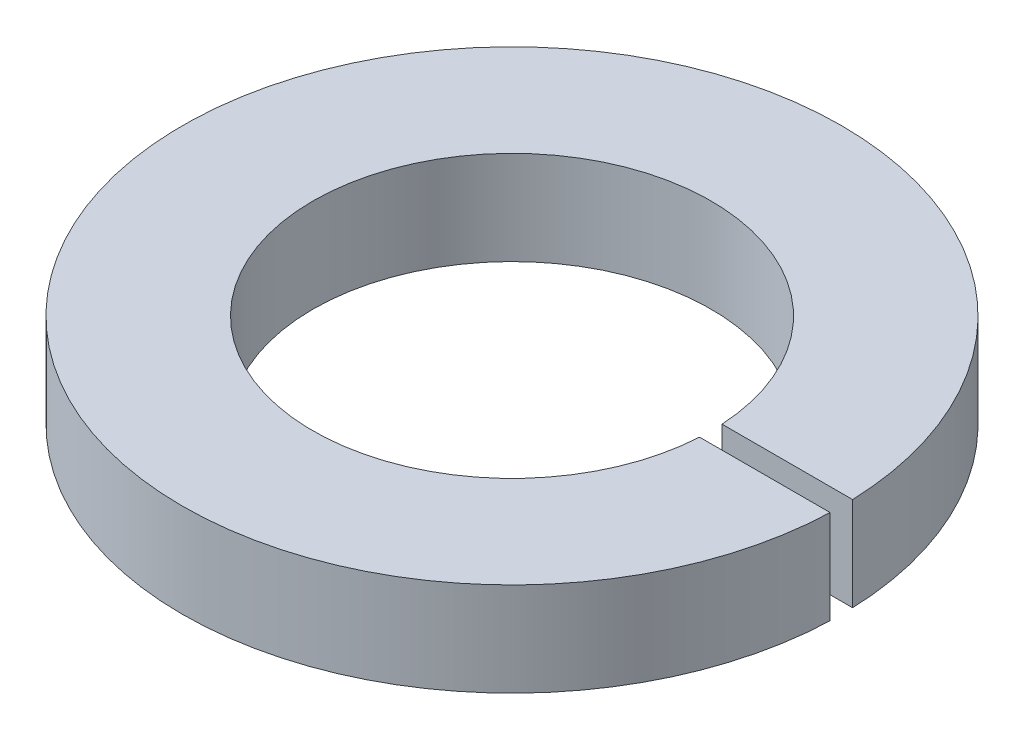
from build123d import *

# Parameters (mm, degrees)
SKETCH1_R          = 11.1633
SKETCH1_R_2        = 6.7437
BASE_EXTRUDE_DEPTH = 3.175
CUT_EXTRUDE1_DEPTH = 17.103389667


with BuildPart() as part:
    # Sketch1 → Base-Extrude (new body)
    with BuildSketch(Plane(origin=(0, 0, 0), x_dir=(1, 0, 0), z_dir=(0, 1, 0))):
        with Locations(Location((0, 0, 0), (0, 0, 270))):
            Circle(SKETCH1_R)
        with Locations(Location((0, 0, 0), (0, 0, 270))):
            Circle(SKETCH1_R_2, mode=Mode.SUBTRACT)
    extrude(amount=BASE_EXTRUDE_DEPTH)

    # Sketch2 → Cut-Extrude1 (cut, through all)
    with BuildSketch(Plane(origin=(0, 3.175, 0), x_dir=(-1, 0, 0), z_dir=(0, 1, 0))):
        with BuildLine():
            Line((-11.156796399, -0.381), (0, -0.381))
            Line((0, -0.381), (0, 0.381))
            Line((0, 0.381), (-11.156796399, 0.381))
            ThreePointArc((-11.156796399, 0.381), (-11.1633, 0), (-11.156796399, -0.381))
        make_face()
    extrude(amount=-CUT_EXTRUDE1_DEPTH, mode=Mode.SUBTRACT)


solid = part.part
